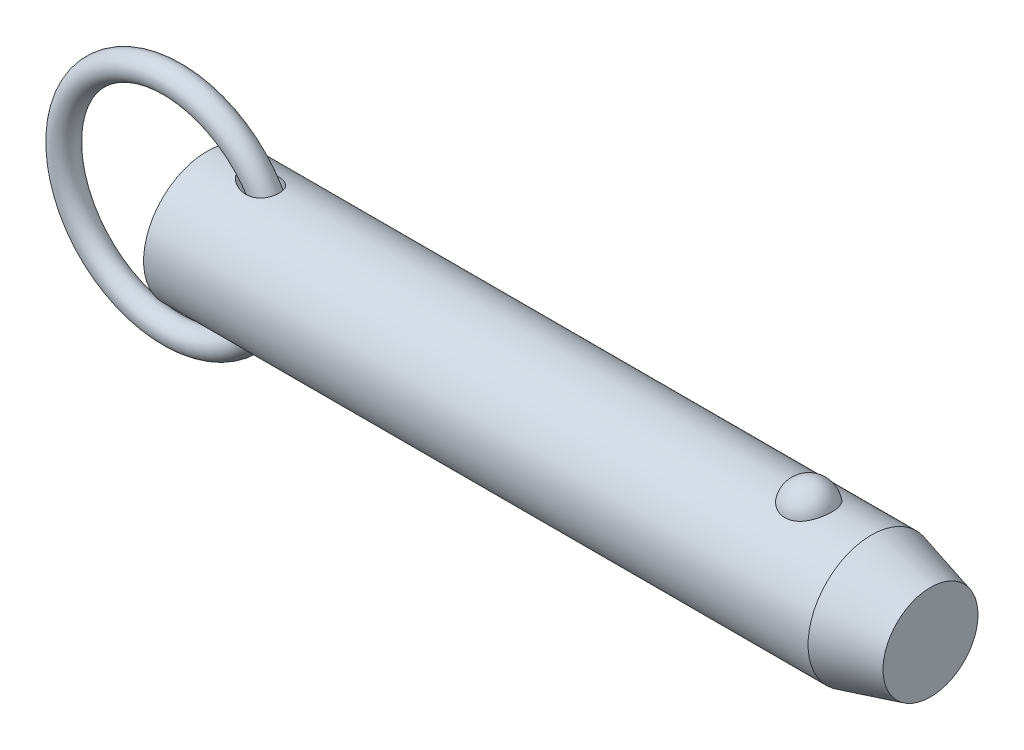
ISO-10303-21;
HEADER;
FILE_DESCRIPTION(('STEP AP214'),'2;1');
FILE_NAME('part.step','',(''),(''),'','','');
FILE_SCHEMA(('AUTOMOTIVE_DESIGN { 1 0 10303 214 1 1 1 1 }'));
ENDSEC;
DATA;
#1=APPLICATION_CONTEXT('core data for automotive mechanical design processes');
#2=APPLICATION_PROTOCOL_DEFINITION('international standard','automotive_design',2000,#1);
#3=PRODUCT_CONTEXT('',#1,'mechanical');
#4=PRODUCT('Part','Part','',(#3));
#5=PRODUCT_RELATED_PRODUCT_CATEGORY('part','',(#4));
#6=PRODUCT_DEFINITION_FORMATION('','',#4);
#7=PRODUCT_DEFINITION_CONTEXT('part definition',#1,'design');
#8=PRODUCT_DEFINITION('design','',#6,#7);
#9=PRODUCT_DEFINITION_SHAPE('','',#8);
#10=(LENGTH_UNIT() NAMED_UNIT(*) SI_UNIT(.MILLI.,.METRE.));
#11=(NAMED_UNIT(*) PLANE_ANGLE_UNIT() SI_UNIT($,.RADIAN.));
#12=(NAMED_UNIT(*) SI_UNIT($,.STERADIAN.) SOLID_ANGLE_UNIT());
#13=UNCERTAINTY_MEASURE_WITH_UNIT(LENGTH_MEASURE(1.E-05),#10,'distance_accuracy_value','');
#14=(GEOMETRIC_REPRESENTATION_CONTEXT(3) GLOBAL_UNCERTAINTY_ASSIGNED_CONTEXT((#13)) GLOBAL_UNIT_ASSIGNED_CONTEXT((#10,
#11,#12)) REPRESENTATION_CONTEXT('',''));
#15=CARTESIAN_POINT('',(0.,0.,0.));
#16=DIRECTION('',(0.,0.,1.));
#17=DIRECTION('',(1.,0.,0.));
#18=AXIS2_PLACEMENT_3D('',#15,#16,#17);
#19=CARTESIAN_POINT('',(-6.08699288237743,0.,0.));
#20=DIRECTION('',(0.,0.,1.));
#21=DIRECTION('',(1.,0.,0.));
#22=AXIS2_PLACEMENT_3D('',#19,#20,#21);
#23=TOROIDAL_SURFACE('',#22,19.05,2.223);
#24=CARTESIAN_POINT('',(15.1860071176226,0.,0.));
#25=VERTEX_POINT('',#24);
#26=VERTEX_LOOP('',#25);
#27=FACE_BOUND('',#26,.T.);
#28=ADVANCED_FACE('P0_F12',(#27),#23,.T.);
#29=CLOSED_SHELL('',(#28));
#30=MANIFOLD_SOLID_BREP('P0_B1',#29);
#31=CARTESIAN_POINT('',(0.,0.,0.));
#32=DIRECTION('',(1.,0.,0.));
#33=DIRECTION('',(0.,0.,-1.));
#34=AXIS2_PLACEMENT_3D('',#31,#32,#33);
#35=CYLINDRICAL_SURFACE('',#34,11.115);
#36=CARTESIAN_POINT('',(6.41405181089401,11.0227946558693,-1.4287136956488));
#37=CARTESIAN_POINT('',(6.49338916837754,11.0115377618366,-1.51556642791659));
#38=CARTESIAN_POINT('',(6.57765461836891,10.9998263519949,-1.59789397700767));
#39=CARTESIAN_POINT('',(6.75386647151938,10.9760304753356,-1.75391400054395));
#40=CARTESIAN_POINT('',(6.84582247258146,10.9639455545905,-1.82759540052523));
#41=CARTESIAN_POINT('',(7.03627827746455,10.9397989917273,-1.96698954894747));
#42=CARTESIAN_POINT('',(7.13480838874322,10.9277377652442,-2.03266078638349));
#43=CARTESIAN_POINT('',(7.33681032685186,10.9041015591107,-2.1558582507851));
#44=CARTESIAN_POINT('',(7.44028007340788,10.8925263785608,-2.21338786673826));
#45=CARTESIAN_POINT('',(7.64386117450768,10.8710104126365,-2.31666528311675));
#46=CARTESIAN_POINT('',(7.74368989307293,10.8610119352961,-2.36295942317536));
#47=CARTESIAN_POINT('',(7.94637195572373,10.8420168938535,-2.44863486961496));
#48=CARTESIAN_POINT('',(8.04922612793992,10.8330206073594,-2.48801426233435));
#49=CARTESIAN_POINT('',(8.36115573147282,10.807980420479,-2.59542730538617));
#50=CARTESIAN_POINT('',(8.57411849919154,10.7938278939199,-2.65299817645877));
#51=CARTESIAN_POINT('',(9.00825016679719,10.7725818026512,-2.73800108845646));
#52=CARTESIAN_POINT('',(9.22947335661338,10.7655491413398,-2.76517330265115));
#53=CARTESIAN_POINT('',(9.67368141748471,10.7605872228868,-2.78445308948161));
#54=CARTESIAN_POINT('',(9.89666486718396,10.7626512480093,-2.77658653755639));
#55=CARTESIAN_POINT('',(10.2950172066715,10.7754452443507,-2.72644436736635));
#56=CARTESIAN_POINT('',(10.4712789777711,10.7844280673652,-2.69109376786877));
#57=CARTESIAN_POINT('',(10.7292776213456,10.8024982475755,-2.61722365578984));
#58=CARTESIAN_POINT('',(10.8142337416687,10.8092901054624,-2.58911576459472));
#59=CARTESIAN_POINT('',(10.9813218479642,10.8242580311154,-2.52581287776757));
#60=CARTESIAN_POINT('',(11.0634550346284,10.8324335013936,-2.49062094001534));
#61=CARTESIAN_POINT('',(11.2247418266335,10.8500287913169,-2.41281958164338));
#62=CARTESIAN_POINT('',(11.3038694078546,10.8594572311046,-2.37015806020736));
#63=CARTESIAN_POINT('',(11.4576781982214,10.8792243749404,-2.27770403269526));
#64=CARTESIAN_POINT('',(11.5323615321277,10.8895626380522,-2.22791497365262));
#65=CARTESIAN_POINT('',(11.6765388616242,10.9108113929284,-2.12140590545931));
#66=CARTESIAN_POINT('',(11.7460329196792,10.9217218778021,-2.06468597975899));
#67=CARTESIAN_POINT('',(11.8790597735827,10.9437207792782,-1.94471764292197));
#68=CARTESIAN_POINT('',(11.9425932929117,10.9548091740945,-1.88147002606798));
#69=CARTESIAN_POINT('',(12.109388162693,10.9851999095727,-1.69784918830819));
#70=CARTESIAN_POINT('',(12.205655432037,11.0042655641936,-1.57093023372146));
#71=CARTESIAN_POINT('',(12.374151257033,11.0393391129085,-1.3017676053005));
#72=CARTESIAN_POINT('',(12.4463875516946,11.0553479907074,-1.15952888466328));
#73=CARTESIAN_POINT('',(12.5615818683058,11.0816338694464,-0.871972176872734));
#74=CARTESIAN_POINT('',(12.6058896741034,11.0921698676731,-0.727217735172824));
#75=CARTESIAN_POINT('',(12.6699315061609,11.1075802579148,-0.432089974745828));
#76=CARTESIAN_POINT('',(12.6896681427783,11.1124552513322,-0.281717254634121));
#77=CARTESIAN_POINT('',(12.7040225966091,11.1159901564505,0.0188164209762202));
#78=CARTESIAN_POINT('',(12.6988836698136,11.1147102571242,0.168965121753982));
#79=CARTESIAN_POINT('',(12.6641681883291,11.1062126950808,0.466238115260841));
#80=CARTESIAN_POINT('',(12.6345920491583,11.0989951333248,0.61336245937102));
#81=CARTESIAN_POINT('',(12.5517453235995,11.0794095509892,0.900330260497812));
#82=CARTESIAN_POINT('',(12.4984878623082,11.0670443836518,1.0401777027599));
#83=CARTESIAN_POINT('',(12.3696588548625,11.0385082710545,1.308745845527));
#84=CARTESIAN_POINT('',(12.2940887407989,11.0223375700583,1.43746725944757));
#85=CARTESIAN_POINT('',(12.122380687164,10.987872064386,1.68079704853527));
#86=CARTESIAN_POINT('',(12.0261637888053,10.969569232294,1.79534850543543));
#87=CARTESIAN_POINT('',(11.8161707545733,10.932836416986,2.00695695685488));
#88=CARTESIAN_POINT('',(11.7023941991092,10.9144064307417,2.10401353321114));
#89=CARTESIAN_POINT('',(11.4575656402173,10.8788057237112,2.28105326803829));
#90=CARTESIAN_POINT('',(11.3261451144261,10.8616794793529,2.36053412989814));
#91=CARTESIAN_POINT('',(11.0523589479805,10.8308019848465,2.49839044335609));
#92=CARTESIAN_POINT('',(10.9099908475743,10.8170514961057,2.55676113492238));
#93=CARTESIAN_POINT('',(10.6060622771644,10.7929728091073,2.65666105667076));
#94=CARTESIAN_POINT('',(10.4438877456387,10.7830209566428,2.69640163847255));
#95=CARTESIAN_POINT('',(10.1154037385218,10.7687230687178,2.75293129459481));
#96=CARTESIAN_POINT('',(9.94909141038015,10.7643810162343,2.76970406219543));
#97=CARTESIAN_POINT('',(9.54387061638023,10.7604809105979,2.7848723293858));
#98=CARTESIAN_POINT('',(9.30446860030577,10.7637793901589,2.77227753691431));
#99=CARTESIAN_POINT('',(8.9496125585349,10.7757341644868,2.72524141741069));
#100=CARTESIAN_POINT('',(8.83186896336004,10.7808994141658,2.70482239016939));
#101=CARTESIAN_POINT('',(8.59835142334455,10.7932548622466,2.6550999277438));
#102=CARTESIAN_POINT('',(8.48257728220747,10.8004448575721,2.62579738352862));
#103=CARTESIAN_POINT('',(8.25208469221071,10.8166382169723,2.55827624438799));
#104=CARTESIAN_POINT('',(8.13740214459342,10.8256649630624,2.51994155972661));
#105=CARTESIAN_POINT('',(7.91132058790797,10.8451170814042,2.43486475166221));
#106=CARTESIAN_POINT('',(7.79992154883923,10.8555424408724,2.38812270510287));
#107=CARTESIAN_POINT('',(7.58115677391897,10.8774251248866,2.28638483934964));
#108=CARTESIAN_POINT('',(7.47378802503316,10.8888816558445,2.23139534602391));
#109=CARTESIAN_POINT('',(7.26385624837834,10.9124540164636,2.1131026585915));
#110=CARTESIAN_POINT('',(7.16129168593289,10.9245696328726,2.04980214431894));
#111=CARTESIAN_POINT('',(6.91882218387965,10.9543689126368,1.88540538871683));
#112=CARTESIAN_POINT('',(6.78193778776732,10.9721958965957,1.77979827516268));
#113=CARTESIAN_POINT('',(6.5247244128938,11.0070222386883,1.54989693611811));
#114=CARTESIAN_POINT('',(6.40436902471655,11.0240228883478,1.42563320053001));
#115=CARTESIAN_POINT('',(6.21838804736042,11.0509658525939,1.19529359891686));
#116=CARTESIAN_POINT('',(6.14691885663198,11.0615430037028,1.09404520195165));
#117=CARTESIAN_POINT('',(6.02043496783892,11.0805004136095,0.881508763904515));
#118=CARTESIAN_POINT('',(5.96539400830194,11.0888841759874,0.770237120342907));
#119=CARTESIAN_POINT('',(5.88475453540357,11.1012553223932,0.560577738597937));
#120=CARTESIAN_POINT('',(5.85559643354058,11.1057686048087,0.463603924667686));
#121=CARTESIAN_POINT('',(5.81381299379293,11.1122523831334,0.266083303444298));
#122=CARTESIAN_POINT('',(5.80117118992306,11.1142254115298,0.165540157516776));
#123=CARTESIAN_POINT('',(5.79363815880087,11.1153999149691,-0.036474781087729));
#124=CARTESIAN_POINT('',(5.79878799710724,11.1145949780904,-0.137948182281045));
#125=CARTESIAN_POINT('',(5.82639592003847,11.1102987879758,-0.338493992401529));
#126=CARTESIAN_POINT('',(5.84887234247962,11.1068046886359,-0.43756374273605));
#127=CARTESIAN_POINT('',(5.91510741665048,11.0965857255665,-0.649968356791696));
#128=CARTESIAN_POINT('',(5.9622090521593,11.0893566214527,-0.762222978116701));
#129=CARTESIAN_POINT('',(6.07378449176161,11.072471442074,-0.977396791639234));
#130=CARTESIAN_POINT('',(6.13826787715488,11.0628140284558,-1.08031079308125));
#131=CARTESIAN_POINT('',(6.2410107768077,11.0477136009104,-1.2219580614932));
#132=CARTESIAN_POINT('',(6.27403486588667,11.042895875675,-1.26469183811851));
#133=CARTESIAN_POINT('',(6.34238022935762,11.0330152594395,-1.34817011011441));
#134=CARTESIAN_POINT('',(6.37769867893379,11.0279526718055,-1.38891694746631));
#135=CARTESIAN_POINT('',(6.41405181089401,11.0227946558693,-1.4287136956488));
#136=B_SPLINE_CURVE_WITH_KNOTS('',3,(#36,#37,#38,#39,#40,#41,#42,#43,#44,#45,#46,#47,#48,#49,
#50,#51,#52,#53,#54,#55,#56,#57,#58,#59,#60,#61,#62,#63,#64,#65,#66,#67,#68,#69,#70,#71,#72,#73,
#74,#75,#76,#77,#78,#79,#80,#81,#82,#83,#84,#85,#86,#87,#88,#89,#90,#91,#92,#93,#94,#95,#96,#97,
#98,#99,#100,#101,#102,#103,#104,#105,#106,#107,#108,#109,#110,#111,#112,#113,#114,#115,#116,
#117,#118,#119,#120,#121,#122,#123,#124,#125,#126,#127,#128,#129,#130,#131,#132,#133,#134,#135),
.UNSPECIFIED.,.T.,.F.,(4,2,2,2,2,2,2,2,2,2,2,2,2,2,2,2,2,2,2,2,2,2,2,2,2,2,2,2,2,2,2,2,2,2,2,2,
2,2,2,2,2,2,2,2,2,2,2,2,2,4),(0.,0.35443329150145,0.709315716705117,1.0659654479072,
1.42246628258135,1.7536715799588,2.08496839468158,2.74582009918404,3.41227815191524,
4.07824412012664,4.61583787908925,4.88478112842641,5.1536085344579,5.42439170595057,
5.69504436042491,5.96569375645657,6.23631025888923,6.71490729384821,7.19335005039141,
7.64641437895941,8.09943057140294,8.54802575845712,8.99661331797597,9.44495256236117,
9.89326303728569,10.3433195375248,10.7933867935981,11.2550086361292,11.7167345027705,
12.2165866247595,12.7167934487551,13.4318876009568,13.7904664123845,14.1490092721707,
14.5124394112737,14.8758662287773,15.239015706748,15.6020483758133,16.1219860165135,
16.6410830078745,17.0130520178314,17.3844231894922,17.6872330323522,17.9897407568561,
18.2929471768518,18.5964749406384,18.9603532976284,19.3244326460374,19.4870338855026,
19.649438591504),.UNSPECIFIED.);
#137=CARTESIAN_POINT('',(6.41405181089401,11.0227946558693,-1.4287136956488));
#138=VERTEX_POINT('',#137);
#139=EDGE_CURVE('P1_E40',#138,#138,#136,.T.);
#140=ORIENTED_EDGE('',*,*,#139,.T.);
#141=EDGE_LOOP('',(#140));
#142=FACE_BOUND('',#141,.T.);
#143=CARTESIAN_POINT('',(116.629563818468,0.,0.));
#144=DIRECTION('',(1.,0.,0.));
#145=DIRECTION('',(0.,0.,-1.));
#146=AXIS2_PLACEMENT_3D('',#143,#144,#145);
#147=CIRCLE('',#146,11.115);
#148=CARTESIAN_POINT('',(116.629563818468,0.,-11.115));
#149=VERTEX_POINT('',#148);
#150=EDGE_CURVE('P1_E25',#149,#149,#147,.T.);
#151=ORIENTED_EDGE('',*,*,#150,.F.);
#152=EDGE_LOOP('',(#151));
#153=FACE_BOUND('',#152,.T.);
#154=CARTESIAN_POINT('',(0.,0.,0.));
#155=DIRECTION('',(1.,0.,0.));
#156=DIRECTION('',(0.,0.,-1.));
#157=AXIS2_PLACEMENT_3D('',#154,#155,#156);
#158=CIRCLE('',#157,11.115);
#159=CARTESIAN_POINT('',(0.,0.,-11.115));
#160=VERTEX_POINT('',#159);
#161=EDGE_CURVE('P1_E9',#160,#160,#158,.T.);
#162=ORIENTED_EDGE('',*,*,#161,.T.);
#163=EDGE_LOOP('',(#162));
#164=FACE_BOUND('',#163,.T.);
#165=CARTESIAN_POINT('',(105.631068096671,10.3028087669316,4.17077409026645));
#166=CARTESIAN_POINT('',(105.414775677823,10.3028003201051,4.17078240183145));
#167=CARTESIAN_POINT('',(105.198548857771,10.3098895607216,4.15340593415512));
#168=CARTESIAN_POINT('',(104.772540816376,10.3373834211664,4.08449540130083));
#169=CARTESIAN_POINT('',(104.562757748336,10.3577841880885,4.0329712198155));
#170=CARTESIAN_POINT('',(104.155782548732,10.4095237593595,3.89746513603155));
#171=CARTESIAN_POINT('',(103.958572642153,10.4408466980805,3.81353029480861));
#172=CARTESIAN_POINT('',(103.581338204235,10.5110236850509,3.61560339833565));
#173=CARTESIAN_POINT('',(103.401317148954,10.5498792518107,3.50160528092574));
#174=CARTESIAN_POINT('',(103.057684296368,10.6322884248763,3.24292464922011));
#175=CARTESIAN_POINT('',(102.894686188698,10.6759443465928,3.09746040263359));
#176=CARTESIAN_POINT('',(102.594591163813,10.7625291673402,2.78171925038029));
#177=CARTESIAN_POINT('',(102.457499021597,10.8054579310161,2.61143778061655));
#178=CARTESIAN_POINT('',(102.206408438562,10.8881935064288,2.24226695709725));
#179=CARTESIAN_POINT('',(102.093710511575,10.9277761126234,2.04244123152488));
#180=CARTESIAN_POINT('',(101.901777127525,10.997484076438,1.62578254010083));
#181=CARTESIAN_POINT('',(101.822544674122,11.0276085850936,1.40894804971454));
#182=CARTESIAN_POINT('',(101.698303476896,11.0756732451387,0.961250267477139));
#183=CARTESIAN_POINT('',(101.653760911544,11.0934470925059,0.730239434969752));
#184=CARTESIAN_POINT('',(101.601569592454,11.1143331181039,0.263439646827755));
#185=CARTESIAN_POINT('',(101.593920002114,11.1174456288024,0.0276507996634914));
#186=CARTESIAN_POINT('',(101.61561056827,11.1087161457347,-0.440729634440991));
#187=CARTESIAN_POINT('',(101.644762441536,11.0969502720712,-0.673331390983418));
#188=CARTESIAN_POINT('',(101.739143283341,11.0597872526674,-1.12996621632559));
#189=CARTESIAN_POINT('',(101.804372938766,11.0343898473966,-1.35399912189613));
#190=CARTESIAN_POINT('',(101.96969844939,10.972515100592,-1.78750286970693));
#191=CARTESIAN_POINT('',(102.06983863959,10.9360236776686,-1.99695478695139));
#192=CARTESIAN_POINT('',(102.302940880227,10.8557595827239,-2.3952066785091));
#193=CARTESIAN_POINT('',(102.435905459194,10.8119863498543,-2.5840050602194));
#194=CARTESIAN_POINT('',(102.732407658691,10.7216733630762,-2.93635726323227));
#195=CARTESIAN_POINT('',(102.896056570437,10.675123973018,-3.09981510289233));
#196=CARTESIAN_POINT('',(103.249860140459,10.5846571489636,-3.39592247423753));
#197=CARTESIAN_POINT('',(103.440012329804,10.5407394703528,-3.52857487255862));
#198=CARTESIAN_POINT('',(103.83750141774,10.4616690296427,-3.75646057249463));
#199=CARTESIAN_POINT('',(104.04436705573,10.4263443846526,-3.8524543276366));
#200=CARTESIAN_POINT('',(104.472954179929,10.3675574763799,-4.00798747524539));
#201=CARTESIAN_POINT('',(104.694670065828,10.344090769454,-4.0675405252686));
#202=CARTESIAN_POINT('',(105.134669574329,10.3128282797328,-4.14614314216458));
#203=CARTESIAN_POINT('',(105.352565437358,10.3043040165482,-4.1670783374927));
#204=CARTESIAN_POINT('',(105.78894951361,10.3016771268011,-4.17357158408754));
#205=CARTESIAN_POINT('',(106.007437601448,10.3075716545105,-4.15913661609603));
#206=CARTESIAN_POINT('',(106.431744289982,10.3326686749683,-4.09636961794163));
#207=CARTESIAN_POINT('',(106.637745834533,10.3514555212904,-4.0490957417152));
#208=CARTESIAN_POINT('',(107.038576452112,10.399818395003,-3.92320197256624));
#209=CARTESIAN_POINT('',(107.2334046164,10.4293952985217,-3.84457953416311));
#210=CARTESIAN_POINT('',(107.611191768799,10.4969600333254,-3.65612410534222));
#211=CARTESIAN_POINT('',(107.793797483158,10.5351178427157,-3.54564545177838));
#212=CARTESIAN_POINT('',(108.138204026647,10.6154999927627,-3.29718036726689));
#213=CARTESIAN_POINT('',(108.300000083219,10.657725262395,-3.15918764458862));
#214=CARTESIAN_POINT('',(108.606959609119,10.744212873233,-2.85163580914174));
#215=CARTESIAN_POINT('',(108.750891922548,10.7884718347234,-2.68084605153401));
#216=CARTESIAN_POINT('',(109.009237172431,10.872374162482,-2.3172186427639));
#217=CARTESIAN_POINT('',(109.123644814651,10.9120167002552,-2.12437704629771));
#218=CARTESIAN_POINT('',(109.323873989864,10.9838919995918,-1.71516999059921));
#219=CARTESIAN_POINT('',(109.40866178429,11.0158465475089,-1.498248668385));
#220=CARTESIAN_POINT('',(109.54268382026,11.0673523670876,-1.05228572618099));
#221=CARTESIAN_POINT('',(109.591917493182,11.086903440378,-0.823243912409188));
#222=CARTESIAN_POINT('',(109.653891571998,11.1116323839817,-0.359087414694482));
#223=CARTESIAN_POINT('',(109.666566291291,11.1167843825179,-0.123962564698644));
#224=CARTESIAN_POINT('',(109.654973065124,11.1121144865,0.345220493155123));
#225=CARTESIAN_POINT('',(109.630705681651,11.1022928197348,0.579278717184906));
#226=CARTESIAN_POINT('',(109.545907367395,11.0687504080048,1.03866534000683));
#227=CARTESIAN_POINT('',(109.485529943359,11.0450885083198,1.26402641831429));
#228=CARTESIAN_POINT('',(109.329853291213,10.9863185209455,1.70076772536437));
#229=CARTESIAN_POINT('',(109.234551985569,10.9512097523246,1.91214712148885));
#230=CARTESIAN_POINT('',(109.010397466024,10.8729733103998,2.31608359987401));
#231=CARTESIAN_POINT('',(108.881380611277,10.8298068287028,2.50854240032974));
#232=CARTESIAN_POINT('',(108.592732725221,10.7401896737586,2.86808766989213));
#233=CARTESIAN_POINT('',(108.433102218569,10.6937390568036,3.03517457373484));
#234=CARTESIAN_POINT('',(108.087534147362,10.6029321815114,3.33857581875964));
#235=CARTESIAN_POINT('',(107.901708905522,10.5585680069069,3.47501541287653));
#236=CARTESIAN_POINT('',(107.507875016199,10.4769321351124,3.71390897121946));
#237=CARTESIAN_POINT('',(107.299863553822,10.439661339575,3.81635861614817));
#238=CARTESIAN_POINT('',(106.854066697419,10.3749407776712,3.98910631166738));
#239=CARTESIAN_POINT('',(106.615234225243,10.3482457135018,4.05700929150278));
#240=CARTESIAN_POINT('',(106.127925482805,10.312188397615,4.14782844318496));
#241=CARTESIAN_POINT('',(105.879453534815,10.3028184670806,4.17076454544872));
#242=CARTESIAN_POINT('',(105.631068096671,10.3028087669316,4.17077409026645));
#243=B_SPLINE_CURVE_WITH_KNOTS('',3,(#165,#166,#167,#168,#169,#170,#171,#172,#173,#174,#175,
#176,#177,#178,#179,#180,#181,#182,#183,#184,#185,#186,#187,#188,#189,#190,#191,#192,#193,#194,
#195,#196,#197,#198,#199,#200,#201,#202,#203,#204,#205,#206,#207,#208,#209,#210,#211,#212,#213,
#214,#215,#216,#217,#218,#219,#220,#221,#222,#223,#224,#225,#226,#227,#228,#229,#230,#231,#232,
#233,#234,#235,#236,#237,#238,#239,#240,#241,#242),.UNSPECIFIED.,.T.,.F.,(4,2,2,2,2,2,2,2,2,2,2,
2,2,2,2,2,2,2,2,2,2,2,2,2,2,2,2,2,2,2,2,2,2,2,2,2,2,2,4),(0.,0.647966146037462,1.29574482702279,
1.94258643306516,2.58955857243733,3.25496465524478,3.92049326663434,4.61566368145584,
5.31089647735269,6.01531821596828,6.71972398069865,7.42054043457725,8.12137023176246,
8.82309331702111,9.52487047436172,10.2292439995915,10.9335519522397,11.6223330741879,
12.3108558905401,12.9647664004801,13.6185478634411,14.2521847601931,14.8858731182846,
15.5334360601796,16.1811472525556,16.8611459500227,17.5412664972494,18.2431855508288,
18.9451158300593,19.6483065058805,20.3514864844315,21.0516982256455,21.7519516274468,
22.4556690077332,23.1593743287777,23.8601491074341,24.5610129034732,25.3054529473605,
26.049562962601),.UNSPECIFIED.);
#244=CARTESIAN_POINT('',(105.631068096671,10.3028087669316,4.17077409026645));
#245=VERTEX_POINT('',#244);
#246=EDGE_CURVE('P1_E34',#245,#245,#243,.T.);
#247=ORIENTED_EDGE('',*,*,#246,.T.);
#248=EDGE_LOOP('',(#247));
#249=FACE_BOUND('',#248,.T.);
#250=CARTESIAN_POINT('',(6.41405181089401,-11.0227946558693,-1.4287136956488));
#251=CARTESIAN_POINT('',(6.33124061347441,-11.0345445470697,-1.33806125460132));
#252=CARTESIAN_POINT('',(6.25372866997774,-11.0458090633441,-1.24240732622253));
#253=CARTESIAN_POINT('',(6.11277905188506,-11.0666115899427,-1.04095704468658));
#254=CARTESIAN_POINT('',(6.0493392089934,-11.0761498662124,-0.935162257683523));
#255=CARTESIAN_POINT('',(5.94029181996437,-11.0927063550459,-0.712476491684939));
#256=CARTESIAN_POINT('',(5.89492964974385,-11.0996897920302,-0.595457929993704));
#257=CARTESIAN_POINT('',(5.8449816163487,-11.1074141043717,-0.414997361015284));
#258=CARTESIAN_POINT('',(5.83135004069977,-11.1095300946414,-0.354047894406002));
#259=CARTESIAN_POINT('',(5.81051649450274,-11.1127688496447,-0.231041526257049));
#260=CARTESIAN_POINT('',(5.80331311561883,-11.1138918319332,-0.1689848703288));
#261=CARTESIAN_POINT('',(5.79296529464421,-11.1155042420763,-0.000484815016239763));
#262=CARTESIAN_POINT('',(5.79625267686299,-11.1149904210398,0.106437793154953));
#263=CARTESIAN_POINT('',(5.82213676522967,-11.1109609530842,0.317809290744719));
#264=CARTESIAN_POINT('',(5.84474662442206,-11.1074432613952,0.422256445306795));
#265=CARTESIAN_POINT('',(5.91113114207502,-11.097197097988,0.63936180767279));
#266=CARTESIAN_POINT('',(5.95733120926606,-11.090102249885,0.751250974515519));
#267=CARTESIAN_POINT('',(6.06709542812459,-11.0734770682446,0.965912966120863));
#268=CARTESIAN_POINT('',(6.13068735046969,-11.06394284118,1.06867085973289));
#269=CARTESIAN_POINT('',(6.30294237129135,-11.0385920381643,1.30890635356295));
#270=CARTESIAN_POINT('',(6.4189620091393,-11.0218881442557,1.44097376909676));
#271=CARTESIAN_POINT('',(6.66989654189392,-10.9871512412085,1.68553954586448));
#272=CARTESIAN_POINT('',(6.80485520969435,-10.9691152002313,1.79799117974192));
#273=CARTESIAN_POINT('',(7.04881236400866,-10.9382283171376,1.97587596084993));
#274=CARTESIAN_POINT('',(7.15465712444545,-10.9253240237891,2.04570822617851));
#275=CARTESIAN_POINT('',(7.37202504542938,-10.9000987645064,2.17611840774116));
#276=CARTESIAN_POINT('',(7.48355057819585,-10.8877780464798,2.23669241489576));
#277=CARTESIAN_POINT('',(7.71132418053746,-10.8641580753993,2.34873831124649));
#278=CARTESIAN_POINT('',(7.82757727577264,-10.8528599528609,2.40020018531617));
#279=CARTESIAN_POINT('',(8.06386825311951,-10.8317234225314,2.49385169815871));
#280=CARTESIAN_POINT('',(8.18390558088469,-10.8218848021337,2.53604268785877));
#281=CARTESIAN_POINT('',(8.42918336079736,-10.8039208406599,2.61152283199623));
#282=CARTESIAN_POINT('',(8.55447802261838,-10.7958283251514,2.64464414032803));
#283=CARTESIAN_POINT('',(8.80752127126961,-10.781995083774,2.70048793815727));
#284=CARTESIAN_POINT('',(8.9352701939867,-10.7762546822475,2.72320899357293));
#285=CARTESIAN_POINT('',(9.19210176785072,-10.7675291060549,2.75750994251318));
#286=CARTESIAN_POINT('',(9.32118105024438,-10.7645381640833,2.76911315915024));
#287=CARTESIAN_POINT('',(9.57984338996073,-10.761622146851,2.78042035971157));
#288=CARTESIAN_POINT('',(9.70942621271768,-10.7616957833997,2.78012934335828));
#289=CARTESIAN_POINT('',(10.0243125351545,-10.7659059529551,2.76381534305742));
#290=CARTESIAN_POINT('',(10.209307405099,-10.7717977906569,2.74099674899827));
#291=CARTESIAN_POINT('',(10.5731188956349,-10.7905408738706,2.66626238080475));
#292=CARTESIAN_POINT('',(10.7519389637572,-10.8033881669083,2.61436313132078));
#293=CARTESIAN_POINT('',(11.0114289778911,-10.8271584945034,2.51336808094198));
#294=CARTESIAN_POINT('',(11.0968318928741,-10.835881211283,2.47562331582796));
#295=CARTESIAN_POINT('',(11.2636000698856,-10.8545688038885,2.39236170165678));
#296=CARTESIAN_POINT('',(11.344967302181,-10.8645330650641,2.3468486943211));
#297=CARTESIAN_POINT('',(11.5027832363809,-10.8853818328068,2.24815967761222));
#298=CARTESIAN_POINT('',(11.5792327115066,-10.8962661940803,2.19498487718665));
#299=CARTESIAN_POINT('',(11.7263315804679,-10.9185541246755,2.08128855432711));
#300=CARTESIAN_POINT('',(11.7969818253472,-10.9299576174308,2.02076811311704));
#301=CARTESIAN_POINT('',(11.9817953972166,-10.9613645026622,1.84513663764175));
#302=CARTESIAN_POINT('',(12.0893012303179,-10.9814643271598,1.72286660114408));
#303=CARTESIAN_POINT('',(12.2803576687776,-11.0193991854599,1.46066991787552));
#304=CARTESIAN_POINT('',(12.3639173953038,-11.0372350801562,1.32075002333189));
#305=CARTESIAN_POINT('',(12.4996220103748,-11.0672969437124,1.03778067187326));
#306=CARTESIAN_POINT('',(12.5535315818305,-11.0798242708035,0.895607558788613));
#307=CARTESIAN_POINT('',(12.636874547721,-11.0995427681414,0.603918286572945));
#308=CARTESIAN_POINT('',(12.6663115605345,-11.1067347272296,0.454403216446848));
#309=CARTESIAN_POINT('',(12.6997387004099,-11.1149224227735,0.154577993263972));
#310=CARTESIAN_POINT('',(12.7040886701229,-11.1160057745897,0.00431019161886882));
#311=CARTESIAN_POINT('',(12.6882048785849,-11.1120956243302,-0.294841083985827));
#312=CARTESIAN_POINT('',(12.6679715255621,-11.1071022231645,-0.44372458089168));
#313=CARTESIAN_POINT('',(12.6034470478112,-11.0915888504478,-0.735688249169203));
#314=CARTESIAN_POINT('',(12.5591858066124,-11.0810757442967,-0.878775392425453));
#315=CARTESIAN_POINT('',(12.4477416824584,-11.0556687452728,-1.15529525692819));
#316=CARTESIAN_POINT('',(12.3805601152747,-11.0407751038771,-1.2887285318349));
#317=CARTESIAN_POINT('',(12.2248919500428,-11.0081839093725,-1.54257976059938));
#318=CARTESIAN_POINT('',(12.1363549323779,-10.9904797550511,-1.66296592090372));
#319=CARTESIAN_POINT('',(11.9406137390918,-10.9541951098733,-1.88726577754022));
#320=CARTESIAN_POINT('',(11.833409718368,-10.9356146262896,-1.99117961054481));
#321=CARTESIAN_POINT('',(11.601318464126,-10.8991360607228,-2.18213646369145));
#322=CARTESIAN_POINT('',(11.4761325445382,-10.8812577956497,-2.26881927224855));
#323=CARTESIAN_POINT('',(11.2134852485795,-10.8482871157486,-2.42157282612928));
#324=CARTESIAN_POINT('',(11.0760218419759,-10.8331951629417,-2.48764015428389));
#325=CARTESIAN_POINT('',(10.7828968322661,-10.8061050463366,-2.60290068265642));
#326=CARTESIAN_POINT('',(10.6266338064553,-10.7943907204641,-2.65062248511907));
#327=CARTESIAN_POINT('',(10.3086617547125,-10.7762429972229,-2.72345054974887));
#328=CARTESIAN_POINT('',(10.146948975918,-10.7698133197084,-2.74854088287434));
#329=CARTESIAN_POINT('',(9.75541304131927,-10.7608036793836,-2.78368719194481));
#330=CARTESIAN_POINT('',(9.52459435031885,-10.7608467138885,-2.78350276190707));
#331=CARTESIAN_POINT('',(9.06604960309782,-10.7702674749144,-2.74677945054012));
#332=CARTESIAN_POINT('',(8.83832966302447,-10.7796615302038,-2.71017697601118));
#333=CARTESIAN_POINT('',(8.38783466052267,-10.8058248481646,-2.60392490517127));
#334=CARTESIAN_POINT('',(8.16517101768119,-10.8226939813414,-2.53382676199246));
#335=CARTESIAN_POINT('',(7.84087311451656,-10.8516548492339,-2.40555545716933));
#336=CARTESIAN_POINT('',(7.73435551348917,-10.8619221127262,-2.35892455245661));
#337=CARTESIAN_POINT('',(7.52510420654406,-10.883357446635,-2.25797017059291));
#338=CARTESIAN_POINT('',(7.4223698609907,-10.8945253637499,-2.20364800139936));
#339=CARTESIAN_POINT('',(7.23808758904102,-10.915528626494,-2.09688018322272));
#340=CARTESIAN_POINT('',(7.15584631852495,-10.9252787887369,-2.0456107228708));
#341=CARTESIAN_POINT('',(6.99510576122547,-10.944960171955,-1.93754729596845));
#342=CARTESIAN_POINT('',(6.91660574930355,-10.9548913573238,-1.88075440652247));
#343=CARTESIAN_POINT('',(6.76418133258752,-10.974690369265,-1.76154504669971));
#344=CARTESIAN_POINT('',(6.69024940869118,-10.9845582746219,-1.6991382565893));
#345=CARTESIAN_POINT('',(6.54780119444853,-11.0039826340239,-1.56842485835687));
#346=CARTESIAN_POINT('',(6.47928247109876,-11.0135392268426,-1.50012092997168));
#347=CARTESIAN_POINT('',(6.41405181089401,-11.0227946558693,-1.4287136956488));
#348=B_SPLINE_CURVE_WITH_KNOTS('',3,(#250,#251,#252,#253,#254,#255,#256,#257,#258,#259,#260,
#261,#262,#263,#264,#265,#266,#267,#268,#269,#270,#271,#272,#273,#274,#275,#276,#277,#278,#279,
#280,#281,#282,#283,#284,#285,#286,#287,#288,#289,#290,#291,#292,#293,#294,#295,#296,#297,#298,
#299,#300,#301,#302,#303,#304,#305,#306,#307,#308,#309,#310,#311,#312,#313,#314,#315,#316,#317,
#318,#319,#320,#321,#322,#323,#324,#325,#326,#327,#328,#329,#330,#331,#332,#333,#334,#335,#336,
#337,#338,#339,#340,#341,#342,#343,#344,#345,#346,#347),.UNSPECIFIED.,.T.,.F.,(4,2,2,2,2,2,2,2,
2,2,2,2,2,2,2,2,2,2,2,2,2,2,2,2,2,2,2,2,2,2,2,2,2,2,2,2,2,2,2,2,2,2,2,2,2,2,2,2,4),(0.,
0.36983565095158,0.739614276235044,1.1142538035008,1.30141910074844,1.48854338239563,
1.8074587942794,2.12659146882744,2.4883888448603,2.85076733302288,3.3776216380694,
3.90571433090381,4.287639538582,4.66972556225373,5.05222896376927,5.43467659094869,
5.82378546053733,6.21294796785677,6.6012922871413,6.98947336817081,7.54669558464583,
8.10360148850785,8.3845853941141,8.66543074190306,8.94623182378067,9.22699162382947,
9.7162888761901,10.2053995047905,10.6608871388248,11.1163074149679,11.5651786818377,
12.0140424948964,12.4623493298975,12.9106304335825,13.3599804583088,13.8093267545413,
14.2672570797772,14.7252632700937,15.214740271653,15.7045615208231,16.3932594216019,
17.083162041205,17.7825738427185,18.1325177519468,18.4824022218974,18.7744056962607,
19.0663523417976,19.3578048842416,19.6491256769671),.UNSPECIFIED.);
#349=CARTESIAN_POINT('',(6.41405181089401,-11.0227946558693,-1.4287136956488));
#350=VERTEX_POINT('',#349);
#351=EDGE_CURVE('P1_E17',#350,#350,#348,.T.);
#352=ORIENTED_EDGE('',*,*,#351,.T.);
#353=EDGE_LOOP('',(#352));
#354=FACE_BOUND('',#353,.T.);
#355=ADVANCED_FACE('P1_F13',(#142,#153,#164,#249,#354),#35,.T.);
#356=CARTESIAN_POINT('',(0.,0.,0.));
#357=DIRECTION('',(-1.,0.,0.));
#358=DIRECTION('',(0.,0.,1.));
#359=AXIS2_PLACEMENT_3D('',#356,#357,#358);
#360=PLANE('',#359);
#361=ORIENTED_EDGE('',*,*,#161,.F.);
#362=EDGE_LOOP('',(#361));
#363=FACE_BOUND('',#362,.T.);
#364=ADVANCED_FACE('P1_F15',(#363),#360,.T.);
#365=CARTESIAN_POINT('',(127.,0.,0.));
#366=DIRECTION('',(-1.,0.,0.));
#367=DIRECTION('',(0.,0.,1.));
#368=AXIS2_PLACEMENT_3D('',#365,#366,#367);
#369=CONICAL_SURFACE('',#368,8.33625000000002,0.26179938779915);
#370=ORIENTED_EDGE('',*,*,#150,.T.);
#371=EDGE_LOOP('',(#370));
#372=FACE_BOUND('',#371,.T.);
#373=CARTESIAN_POINT('',(127.,0.,0.));
#374=DIRECTION('',(1.,0.,0.));
#375=DIRECTION('',(0.,0.,-1.));
#376=AXIS2_PLACEMENT_3D('',#373,#374,#375);
#377=CIRCLE('',#376,8.33625000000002);
#378=CARTESIAN_POINT('',(127.,0.,-8.33625000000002));
#379=VERTEX_POINT('',#378);
#380=EDGE_CURVE('P1_E30',#379,#379,#377,.T.);
#381=ORIENTED_EDGE('',*,*,#380,.F.);
#382=EDGE_LOOP('',(#381));
#383=FACE_BOUND('',#382,.T.);
#384=ADVANCED_FACE('P1_F55',(#372,#383),#369,.T.);
#385=CARTESIAN_POINT('',(127.,8.33625000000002,0.));
#386=DIRECTION('',(1.,0.,0.));
#387=DIRECTION('',(0.,0.,-1.));
#388=AXIS2_PLACEMENT_3D('',#385,#386,#387);
#389=PLANE('',#388);
#390=ORIENTED_EDGE('',*,*,#380,.T.);
#391=EDGE_LOOP('',(#390));
#392=FACE_BOUND('',#391,.T.);
#393=ADVANCED_FACE('P1_F51',(#392),#389,.T.);
#394=CARTESIAN_POINT('',(105.631068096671,10.0035,0.));
#395=DIRECTION('',(-1.,0.,0.));
#396=DIRECTION('',(0.,1.,0.));
#397=AXIS2_PLACEMENT_3D('',#394,#395,#396);
#398=SPHERICAL_SURFACE('',#397,4.18150000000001);
#399=ORIENTED_EDGE('',*,*,#246,.F.);
#400=EDGE_LOOP('',(#399));
#401=FACE_BOUND('',#400,.T.);
#402=ADVANCED_FACE('P1_F46',(#401),#398,.T.);
#403=CARTESIAN_POINT('',(-6.08699288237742,0.,0.));
#404=DIRECTION('',(0.,0.,1.));
#405=DIRECTION('',(1.,0.,0.));
#406=AXIS2_PLACEMENT_3D('',#403,#404,#405);
#407=TOROIDAL_SURFACE('',#406,19.05,2.77875);
#408=ORIENTED_EDGE('',*,*,#351,.F.);
#409=EDGE_LOOP('',(#408));
#410=FACE_BOUND('',#409,.T.);
#411=ORIENTED_EDGE('',*,*,#139,.F.);
#412=EDGE_LOOP('',(#411));
#413=FACE_BOUND('',#412,.T.);
#414=ADVANCED_FACE('P1_F50',(#410,#413),#407,.F.);
#415=CLOSED_SHELL('',(#355,#364,#384,#393,#402,#414));
#416=MANIFOLD_SOLID_BREP('P1_B1',#415);
#417=ADVANCED_BREP_SHAPE_REPRESENTATION('',(#18,#30,#416),#14);
#418=SHAPE_DEFINITION_REPRESENTATION(#9,#417);
ENDSEC;
END-ISO-10303-21;
